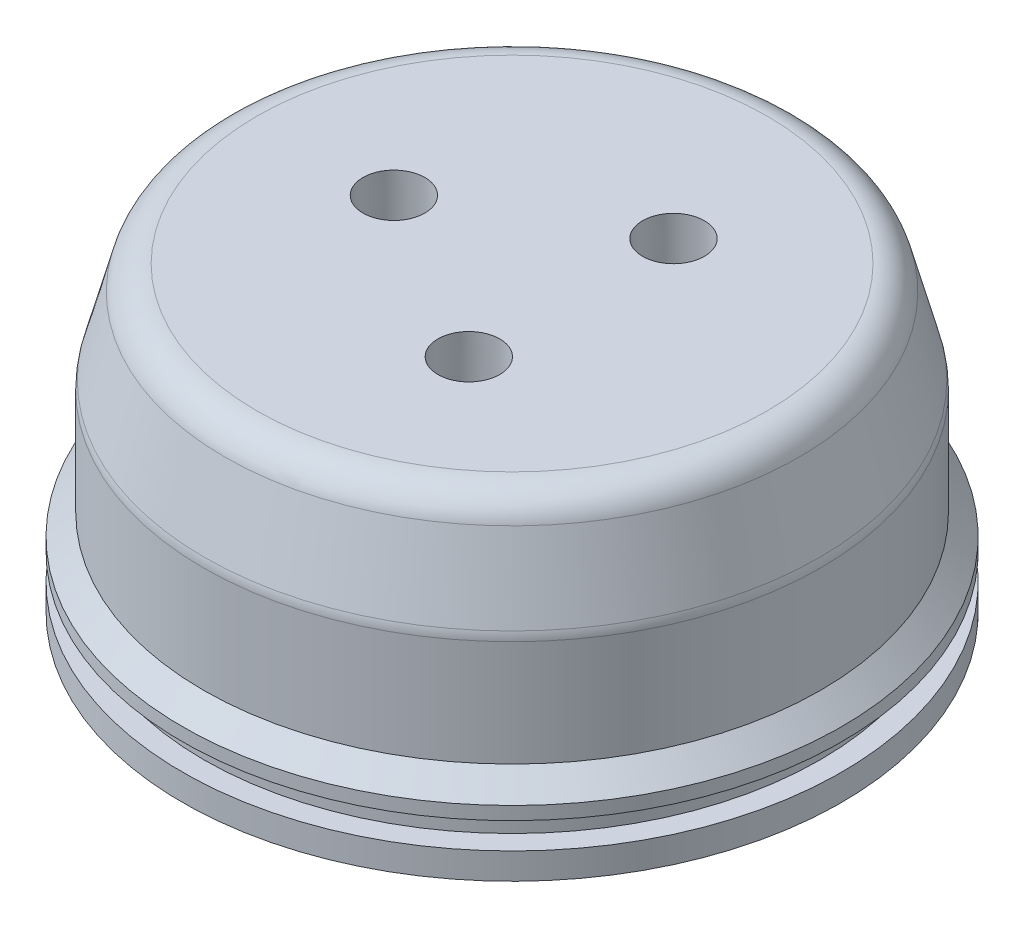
ISO-10303-21;
HEADER;
FILE_DESCRIPTION(('STEP AP214'),'2;1');
FILE_NAME('part.step','',(''),(''),'','','');
FILE_SCHEMA(('AUTOMOTIVE_DESIGN { 1 0 10303 214 1 1 1 1 }'));
ENDSEC;
DATA;
#1=APPLICATION_CONTEXT('core data for automotive mechanical design processes');
#2=APPLICATION_PROTOCOL_DEFINITION('international standard','automotive_design',2000,#1);
#3=PRODUCT_CONTEXT('',#1,'mechanical');
#4=PRODUCT('Part','Part','',(#3));
#5=PRODUCT_RELATED_PRODUCT_CATEGORY('part','',(#4));
#6=PRODUCT_DEFINITION_FORMATION('','',#4);
#7=PRODUCT_DEFINITION_CONTEXT('part definition',#1,'design');
#8=PRODUCT_DEFINITION('design','',#6,#7);
#9=PRODUCT_DEFINITION_SHAPE('','',#8);
#10=(LENGTH_UNIT() NAMED_UNIT(*) SI_UNIT(.MILLI.,.METRE.));
#11=(NAMED_UNIT(*) PLANE_ANGLE_UNIT() SI_UNIT($,.RADIAN.));
#12=(NAMED_UNIT(*) SI_UNIT($,.STERADIAN.) SOLID_ANGLE_UNIT());
#13=UNCERTAINTY_MEASURE_WITH_UNIT(LENGTH_MEASURE(1.E-05),#10,'distance_accuracy_value','');
#14=(GEOMETRIC_REPRESENTATION_CONTEXT(3) GLOBAL_UNCERTAINTY_ASSIGNED_CONTEXT((#13)) GLOBAL_UNIT_ASSIGNED_CONTEXT((#10,
#11,#12)) REPRESENTATION_CONTEXT('',''));
#15=CARTESIAN_POINT('',(0.,0.,0.));
#16=DIRECTION('',(0.,0.,1.));
#17=DIRECTION('',(1.,0.,0.));
#18=AXIS2_PLACEMENT_3D('',#15,#16,#17);
#19=CARTESIAN_POINT('',(-54.2452724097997,58.42,0.));
#20=DIRECTION('',(0.,-1.,0.));
#21=DIRECTION('',(0.,0.,-1.));
#22=AXIS2_PLACEMENT_3D('',#19,#20,#21);
#23=PLANE('',#22);
#24=CARTESIAN_POINT('',(0.,58.42,0.));
#25=DIRECTION('',(0.,-1.,0.));
#26=DIRECTION('',(0.,0.,-1.));
#27=AXIS2_PLACEMENT_3D('',#24,#25,#26);
#28=CIRCLE('',#27,49.3727460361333);
#29=CARTESIAN_POINT('',(0.,58.42,-49.3727460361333));
#30=VERTEX_POINT('',#29);
#31=EDGE_CURVE('E39',#30,#30,#28,.F.);
#32=ORIENTED_EDGE('',*,*,#31,.T.);
#33=EDGE_LOOP('',(#32));
#34=FACE_BOUND('',#33,.T.);
#35=CARTESIAN_POINT('',(11.4299999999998,58.42,19.7973407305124));
#36=DIRECTION('',(0.,-1.,0.));
#37=DIRECTION('',(0.,0.,-1.));
#38=AXIS2_PLACEMENT_3D('',#35,#36,#37);
#39=CIRCLE('',#38,5.97790349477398);
#40=CARTESIAN_POINT('',(11.4299999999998,58.42,13.8194372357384));
#41=VERTEX_POINT('',#40);
#42=EDGE_CURVE('E94',#41,#41,#39,.T.);
#43=ORIENTED_EDGE('',*,*,#42,.T.);
#44=EDGE_LOOP('',(#43));
#45=FACE_BOUND('',#44,.T.);
#46=CARTESIAN_POINT('',(-22.86,58.42,0.));
#47=DIRECTION('',(0.,-1.,0.));
#48=DIRECTION('',(0.,0.,-1.));
#49=AXIS2_PLACEMENT_3D('',#46,#47,#48);
#50=CIRCLE('',#49,5.97790349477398);
#51=CARTESIAN_POINT('',(-22.86,58.42,-5.97790349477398));
#52=VERTEX_POINT('',#51);
#53=EDGE_CURVE('E82',#52,#52,#50,.T.);
#54=ORIENTED_EDGE('',*,*,#53,.T.);
#55=EDGE_LOOP('',(#54));
#56=FACE_BOUND('',#55,.T.);
#57=CARTESIAN_POINT('',(11.4300000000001,58.42,-19.7973407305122));
#58=DIRECTION('',(0.,-1.,0.));
#59=DIRECTION('',(0.,0.,-1.));
#60=AXIS2_PLACEMENT_3D('',#57,#58,#59);
#61=CIRCLE('',#60,5.97790349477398);
#62=CARTESIAN_POINT('',(11.4300000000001,58.42,-25.7752442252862));
#63=VERTEX_POINT('',#62);
#64=EDGE_CURVE('E88',#63,#63,#61,.T.);
#65=ORIENTED_EDGE('',*,*,#64,.T.);
#66=EDGE_LOOP('',(#65));
#67=FACE_BOUND('',#66,.T.);
#68=ADVANCED_FACE('F32',(#34,#45,#56,#67),#23,.F.);
#69=CARTESIAN_POINT('',(0.,0.,0.));
#70=DIRECTION('',(0.,-1.,0.));
#71=DIRECTION('',(0.,0.,-1.));
#72=AXIS2_PLACEMENT_3D('',#69,#70,#71);
#73=CYLINDRICAL_SURFACE('',#72,63.754);
#74=CARTESIAN_POINT('',(0.,10.16,0.));
#75=DIRECTION('',(0.,-1.,0.));
#76=DIRECTION('',(0.,0.,-1.));
#77=AXIS2_PLACEMENT_3D('',#74,#75,#76);
#78=CIRCLE('',#77,63.754);
#79=CARTESIAN_POINT('',(0.,10.16,-63.754));
#80=VERTEX_POINT('',#79);
#81=EDGE_CURVE('E79',#80,#80,#78,.T.);
#82=ORIENTED_EDGE('',*,*,#81,.F.);
#83=EDGE_LOOP('',(#82));
#84=FACE_BOUND('',#83,.T.);
#85=CARTESIAN_POINT('',(0.,12.7,0.));
#86=DIRECTION('',(0.,-1.,0.));
#87=DIRECTION('',(0.,0.,-1.));
#88=AXIS2_PLACEMENT_3D('',#85,#86,#87);
#89=CIRCLE('',#88,63.754);
#90=CARTESIAN_POINT('',(0.,12.7,-63.754));
#91=VERTEX_POINT('',#90);
#92=EDGE_CURVE('E58',#91,#91,#89,.T.);
#93=ORIENTED_EDGE('',*,*,#92,.T.);
#94=EDGE_LOOP('',(#93));
#95=FACE_BOUND('',#94,.T.);
#96=ADVANCED_FACE('F125',(#84,#95),#73,.T.);
#97=CARTESIAN_POINT('',(0.,16.764,0.));
#98=DIRECTION('',(0.,-1.,0.));
#99=DIRECTION('',(0.,0.,-1.));
#100=AXIS2_PLACEMENT_3D('',#97,#98,#99);
#101=CONICAL_SURFACE('',#100,59.69,0.785398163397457);
#102=ORIENTED_EDGE('',*,*,#92,.F.);
#103=EDGE_LOOP('',(#102));
#104=FACE_BOUND('',#103,.T.);
#105=CARTESIAN_POINT('',(0.,16.764,0.));
#106=DIRECTION('',(0.,-1.,0.));
#107=DIRECTION('',(0.,0.,-1.));
#108=AXIS2_PLACEMENT_3D('',#105,#106,#107);
#109=CIRCLE('',#108,59.69);
#110=CARTESIAN_POINT('',(0.,16.764,-59.69));
#111=VERTEX_POINT('',#110);
#112=EDGE_CURVE('E61',#111,#111,#109,.T.);
#113=ORIENTED_EDGE('',*,*,#112,.T.);
#114=EDGE_LOOP('',(#113));
#115=FACE_BOUND('',#114,.T.);
#116=ADVANCED_FACE('F166',(#104,#115),#101,.T.);
#117=CARTESIAN_POINT('',(0.,0.,0.));
#118=DIRECTION('',(0.,-1.,0.));
#119=DIRECTION('',(0.,0.,-1.));
#120=AXIS2_PLACEMENT_3D('',#117,#118,#119);
#121=CYLINDRICAL_SURFACE('',#120,59.69);
#122=CARTESIAN_POINT('',(0.,37.26400664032,0.));
#123=DIRECTION('',(0.,1.,0.));
#124=DIRECTION('',(0.,0.,1.));
#125=AXIS2_PLACEMENT_3D('',#122,#123,#124);
#126=CIRCLE('',#125,59.69);
#127=CARTESIAN_POINT('',(0.,37.26400664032,59.69));
#128=VERTEX_POINT('',#127);
#129=EDGE_CURVE('E10',#128,#128,#126,.F.);
#130=ORIENTED_EDGE('',*,*,#129,.T.);
#131=EDGE_LOOP('',(#130));
#132=FACE_BOUND('',#131,.T.);
#133=ORIENTED_EDGE('',*,*,#112,.F.);
#134=EDGE_LOOP('',(#133));
#135=FACE_BOUND('',#134,.T.);
#136=ADVANCED_FACE('F162',(#132,#135),#121,.T.);
#137=CARTESIAN_POINT('',(0.,58.42,0.));
#138=DIRECTION('',(0.,-1.,0.));
#139=DIRECTION('',(0.,0.,-1.));
#140=AXIS2_PLACEMENT_3D('',#137,#138,#139);
#141=CONICAL_SURFACE('',#140,54.2452724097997,0.261799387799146);
#142=CARTESIAN_POINT('',(0.,53.713500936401,0.));
#143=DIRECTION('',(0.,1.,0.));
#144=DIRECTION('',(0.,0.,1.));
#145=AXIS2_PLACEMENT_3D('',#142,#143,#144);
#146=CIRCLE('',#145,55.5063750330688);
#147=CARTESIAN_POINT('',(0.,53.713500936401,55.5063750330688));
#148=VERTEX_POINT('',#147);
#149=EDGE_CURVE('E43',#148,#148,#146,.F.);
#150=ORIENTED_EDGE('',*,*,#149,.T.);
#151=EDGE_LOOP('',(#150));
#152=FACE_BOUND('',#151,.T.);
#153=CARTESIAN_POINT('',(0.,38.907507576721,0.));
#154=DIRECTION('',(0.,1.,0.));
#155=DIRECTION('',(0.,0.,1.));
#156=AXIS2_PLACEMENT_3D('',#153,#154,#155);
#157=CIRCLE('',#156,59.4736289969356);
#158=CARTESIAN_POINT('',(0.,38.907507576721,59.4736289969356));
#159=VERTEX_POINT('',#158);
#160=EDGE_CURVE('E47',#159,#159,#157,.T.);
#161=ORIENTED_EDGE('',*,*,#160,.T.);
#162=EDGE_LOOP('',(#161));
#163=FACE_BOUND('',#162,.T.);
#164=ADVANCED_FACE('F108',(#152,#163),#141,.T.);
#165=CARTESIAN_POINT('',(-50.8,49.53,0.));
#166=DIRECTION('',(0.,1.,0.));
#167=DIRECTION('',(0.,0.,1.));
#168=AXIS2_PLACEMENT_3D('',#165,#166,#167);
#169=PLANE('',#168);
#170=CARTESIAN_POINT('',(0.,49.53,0.));
#171=DIRECTION('',(0.,1.,0.));
#172=DIRECTION('',(0.,0.,1.));
#173=AXIS2_PLACEMENT_3D('',#170,#171,#172);
#174=CIRCLE('',#173,44.45);
#175=CARTESIAN_POINT('',(0.,49.53,44.45));
#176=VERTEX_POINT('',#175);
#177=EDGE_CURVE('E55',#176,#176,#174,.F.);
#178=ORIENTED_EDGE('',*,*,#177,.T.);
#179=EDGE_LOOP('',(#178));
#180=FACE_BOUND('',#179,.T.);
#181=CARTESIAN_POINT('',(11.4299999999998,49.53,19.7973407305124));
#182=DIRECTION('',(0.,-1.,0.));
#183=DIRECTION('',(0.,0.,-1.));
#184=AXIS2_PLACEMENT_3D('',#181,#182,#183);
#185=CIRCLE('',#184,6.244082);
#186=CARTESIAN_POINT('',(11.4299999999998,49.53,13.5532587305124));
#187=VERTEX_POINT('',#186);
#188=EDGE_CURVE('E97',#187,#187,#185,.T.);
#189=ORIENTED_EDGE('',*,*,#188,.F.);
#190=EDGE_LOOP('',(#189));
#191=FACE_BOUND('',#190,.T.);
#192=CARTESIAN_POINT('',(11.4300000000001,49.53,-19.7973407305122));
#193=DIRECTION('',(0.,-1.,0.));
#194=DIRECTION('',(0.,0.,-1.));
#195=AXIS2_PLACEMENT_3D('',#192,#193,#194);
#196=CIRCLE('',#195,6.244082);
#197=CARTESIAN_POINT('',(11.4300000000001,49.53,-26.0414227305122));
#198=VERTEX_POINT('',#197);
#199=EDGE_CURVE('E91',#198,#198,#196,.T.);
#200=ORIENTED_EDGE('',*,*,#199,.F.);
#201=EDGE_LOOP('',(#200));
#202=FACE_BOUND('',#201,.T.);
#203=CARTESIAN_POINT('',(-22.86,49.53,0.));
#204=DIRECTION('',(0.,-1.,0.));
#205=DIRECTION('',(0.,0.,-1.));
#206=AXIS2_PLACEMENT_3D('',#203,#204,#205);
#207=CIRCLE('',#206,6.244082);
#208=CARTESIAN_POINT('',(-22.86,49.53,-6.244082));
#209=VERTEX_POINT('',#208);
#210=EDGE_CURVE('E85',#209,#209,#207,.T.);
#211=ORIENTED_EDGE('',*,*,#210,.F.);
#212=EDGE_LOOP('',(#211));
#213=FACE_BOUND('',#212,.T.);
#214=ADVANCED_FACE('F104',(#180,#191,#202,#213),#169,.F.);
#215=CARTESIAN_POINT('',(0.,0.,0.));
#216=DIRECTION('',(0.,-1.,0.));
#217=DIRECTION('',(0.,0.,-1.));
#218=AXIS2_PLACEMENT_3D('',#215,#216,#217);
#219=CYLINDRICAL_SURFACE('',#218,50.8);
#220=CARTESIAN_POINT('',(0.,43.18,0.));
#221=DIRECTION('',(0.,1.,0.));
#222=DIRECTION('',(0.,0.,1.));
#223=AXIS2_PLACEMENT_3D('',#220,#221,#222);
#224=CIRCLE('',#223,50.8);
#225=CARTESIAN_POINT('',(0.,43.18,50.8));
#226=VERTEX_POINT('',#225);
#227=EDGE_CURVE('E52',#226,#226,#224,.T.);
#228=ORIENTED_EDGE('',*,*,#227,.T.);
#229=EDGE_LOOP('',(#228));
#230=FACE_BOUND('',#229,.T.);
#231=CARTESIAN_POINT('',(0.,0.,0.));
#232=DIRECTION('',(0.,-1.,0.));
#233=DIRECTION('',(0.,0.,-1.));
#234=AXIS2_PLACEMENT_3D('',#231,#232,#233);
#235=CIRCLE('',#234,50.8);
#236=CARTESIAN_POINT('',(0.,0.,-50.8));
#237=VERTEX_POINT('',#236);
#238=EDGE_CURVE('E64',#237,#237,#235,.T.);
#239=ORIENTED_EDGE('',*,*,#238,.T.);
#240=EDGE_LOOP('',(#239));
#241=FACE_BOUND('',#240,.T.);
#242=ADVANCED_FACE('F107',(#230,#241),#219,.F.);
#243=CARTESIAN_POINT('',(-50.8,0.,0.));
#244=DIRECTION('',(0.,1.,0.));
#245=DIRECTION('',(0.,0.,1.));
#246=AXIS2_PLACEMENT_3D('',#243,#244,#245);
#247=PLANE('',#246);
#248=ORIENTED_EDGE('',*,*,#238,.F.);
#249=EDGE_LOOP('',(#248));
#250=FACE_BOUND('',#249,.T.);
#251=CARTESIAN_POINT('',(0.,0.,0.));
#252=DIRECTION('',(0.,-1.,0.));
#253=DIRECTION('',(0.,0.,-1.));
#254=AXIS2_PLACEMENT_3D('',#251,#252,#253);
#255=CIRCLE('',#254,63.754);
#256=CARTESIAN_POINT('',(0.,0.,-63.754));
#257=VERTEX_POINT('',#256);
#258=EDGE_CURVE('E67',#257,#257,#255,.T.);
#259=ORIENTED_EDGE('',*,*,#258,.T.);
#260=EDGE_LOOP('',(#259));
#261=FACE_BOUND('',#260,.T.);
#262=ADVANCED_FACE('F152',(#250,#261),#247,.F.);
#263=CARTESIAN_POINT('',(0.,0.,0.));
#264=DIRECTION('',(0.,-1.,0.));
#265=DIRECTION('',(0.,0.,-1.));
#266=AXIS2_PLACEMENT_3D('',#263,#264,#265);
#267=CYLINDRICAL_SURFACE('',#266,63.754);
#268=ORIENTED_EDGE('',*,*,#258,.F.);
#269=EDGE_LOOP('',(#268));
#270=FACE_BOUND('',#269,.T.);
#271=CARTESIAN_POINT('',(0.,5.07999999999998,0.));
#272=DIRECTION('',(0.,-1.,0.));
#273=DIRECTION('',(0.,0.,-1.));
#274=AXIS2_PLACEMENT_3D('',#271,#272,#273);
#275=CIRCLE('',#274,63.754);
#276=CARTESIAN_POINT('',(0.,5.07999999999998,-63.754));
#277=VERTEX_POINT('',#276);
#278=EDGE_CURVE('E70',#277,#277,#275,.T.);
#279=ORIENTED_EDGE('',*,*,#278,.T.);
#280=EDGE_LOOP('',(#279));
#281=FACE_BOUND('',#280,.T.);
#282=ADVANCED_FACE('F148',(#270,#281),#267,.T.);
#283=CARTESIAN_POINT('',(-59.6194907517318,5.07999999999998,0.));
#284=DIRECTION('',(0.,-1.,0.));
#285=DIRECTION('',(0.,0.,-1.));
#286=AXIS2_PLACEMENT_3D('',#283,#284,#285);
#287=PLANE('',#286);
#288=ORIENTED_EDGE('',*,*,#278,.F.);
#289=EDGE_LOOP('',(#288));
#290=FACE_BOUND('',#289,.T.);
#291=CARTESIAN_POINT('',(0.,5.07999999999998,0.));
#292=DIRECTION('',(0.,-1.,0.));
#293=DIRECTION('',(0.,0.,-1.));
#294=AXIS2_PLACEMENT_3D('',#291,#292,#293);
#295=CIRCLE('',#294,59.6194907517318);
#296=CARTESIAN_POINT('',(0.,5.07999999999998,-59.6194907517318));
#297=VERTEX_POINT('',#296);
#298=EDGE_CURVE('E73',#297,#297,#295,.T.);
#299=ORIENTED_EDGE('',*,*,#298,.T.);
#300=EDGE_LOOP('',(#299));
#301=FACE_BOUND('',#300,.T.);
#302=ADVANCED_FACE('F144',(#290,#301),#287,.F.);
#303=CARTESIAN_POINT('',(0.,0.,0.));
#304=DIRECTION('',(0.,-1.,0.));
#305=DIRECTION('',(0.,0.,-1.));
#306=AXIS2_PLACEMENT_3D('',#303,#304,#305);
#307=CYLINDRICAL_SURFACE('',#306,59.6194907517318);
#308=ORIENTED_EDGE('',*,*,#298,.F.);
#309=EDGE_LOOP('',(#308));
#310=FACE_BOUND('',#309,.T.);
#311=CARTESIAN_POINT('',(0.,10.16,0.));
#312=DIRECTION('',(0.,-1.,0.));
#313=DIRECTION('',(0.,0.,-1.));
#314=AXIS2_PLACEMENT_3D('',#311,#312,#313);
#315=CIRCLE('',#314,59.6194907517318);
#316=CARTESIAN_POINT('',(0.,10.16,-59.6194907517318));
#317=VERTEX_POINT('',#316);
#318=EDGE_CURVE('E76',#317,#317,#315,.T.);
#319=ORIENTED_EDGE('',*,*,#318,.T.);
#320=EDGE_LOOP('',(#319));
#321=FACE_BOUND('',#320,.T.);
#322=ADVANCED_FACE('F140',(#310,#321),#307,.T.);
#323=CARTESIAN_POINT('',(-63.754,10.16,0.));
#324=DIRECTION('',(0.,1.,0.));
#325=DIRECTION('',(0.,0.,1.));
#326=AXIS2_PLACEMENT_3D('',#323,#324,#325);
#327=PLANE('',#326);
#328=ORIENTED_EDGE('',*,*,#318,.F.);
#329=EDGE_LOOP('',(#328));
#330=FACE_BOUND('',#329,.T.);
#331=ORIENTED_EDGE('',*,*,#81,.T.);
#332=EDGE_LOOP('',(#331));
#333=FACE_BOUND('',#332,.T.);
#334=ADVANCED_FACE('F119',(#330,#333),#327,.F.);
#335=CARTESIAN_POINT('',(-22.86,49.53,0.));
#336=DIRECTION('',(0.,-1.,0.));
#337=DIRECTION('',(0.,0.,-1.));
#338=AXIS2_PLACEMENT_3D('',#335,#336,#337);
#339=CONICAL_SURFACE('',#338,6.244082,0.0299323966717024);
#340=ORIENTED_EDGE('',*,*,#210,.T.);
#341=EDGE_LOOP('',(#340));
#342=FACE_BOUND('',#341,.T.);
#343=ORIENTED_EDGE('',*,*,#53,.F.);
#344=EDGE_LOOP('',(#343));
#345=FACE_BOUND('',#344,.T.);
#346=ADVANCED_FACE('F115',(#342,#345),#339,.F.);
#347=CARTESIAN_POINT('',(11.4300000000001,49.53,-19.7973407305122));
#348=DIRECTION('',(0.,-1.,0.));
#349=DIRECTION('',(0.,0.,-1.));
#350=AXIS2_PLACEMENT_3D('',#347,#348,#349);
#351=CONICAL_SURFACE('',#350,6.244082,0.0299323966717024);
#352=ORIENTED_EDGE('',*,*,#199,.T.);
#353=EDGE_LOOP('',(#352));
#354=FACE_BOUND('',#353,.T.);
#355=ORIENTED_EDGE('',*,*,#64,.F.);
#356=EDGE_LOOP('',(#355));
#357=FACE_BOUND('',#356,.T.);
#358=ADVANCED_FACE('F118',(#354,#357),#351,.F.);
#359=CARTESIAN_POINT('',(11.4299999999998,49.53,19.7973407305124));
#360=DIRECTION('',(0.,-1.,0.));
#361=DIRECTION('',(0.,0.,-1.));
#362=AXIS2_PLACEMENT_3D('',#359,#360,#361);
#363=CONICAL_SURFACE('',#362,6.244082,0.0299323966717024);
#364=ORIENTED_EDGE('',*,*,#188,.T.);
#365=EDGE_LOOP('',(#364));
#366=FACE_BOUND('',#365,.T.);
#367=ORIENTED_EDGE('',*,*,#42,.F.);
#368=EDGE_LOOP('',(#367));
#369=FACE_BOUND('',#368,.T.);
#370=ADVANCED_FACE('F101',(#366,#369),#363,.F.);
#371=CARTESIAN_POINT('',(0.,43.18,0.));
#372=DIRECTION('',(0.,1.,0.));
#373=DIRECTION('',(0.,0.,1.));
#374=AXIS2_PLACEMENT_3D('',#371,#372,#373);
#375=TOROIDAL_SURFACE('',#374,44.45,6.35);
#376=ORIENTED_EDGE('',*,*,#227,.F.);
#377=EDGE_LOOP('',(#376));
#378=FACE_BOUND('',#377,.T.);
#379=ORIENTED_EDGE('',*,*,#177,.F.);
#380=EDGE_LOOP('',(#379));
#381=FACE_BOUND('',#380,.T.);
#382=ADVANCED_FACE('F135',(#378,#381),#375,.F.);
#383=CARTESIAN_POINT('',(0.,52.07,0.));
#384=DIRECTION('',(0.,-1.,0.));
#385=DIRECTION('',(0.,0.,-1.));
#386=AXIS2_PLACEMENT_3D('',#383,#384,#385);
#387=TOROIDAL_SURFACE('',#386,49.3727460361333,6.35);
#388=ORIENTED_EDGE('',*,*,#31,.F.);
#389=EDGE_LOOP('',(#388));
#390=FACE_BOUND('',#389,.T.);
#391=ORIENTED_EDGE('',*,*,#149,.F.);
#392=EDGE_LOOP('',(#391));
#393=FACE_BOUND('',#392,.T.);
#394=ADVANCED_FACE('F174',(#390,#393),#387,.T.);
#395=CARTESIAN_POINT('',(0.,37.26400664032,0.));
#396=DIRECTION('',(0.,1.,0.));
#397=DIRECTION('',(0.,0.,1.));
#398=AXIS2_PLACEMENT_3D('',#395,#396,#397);
#399=TOROIDAL_SURFACE('',#398,53.34,6.35);
#400=ORIENTED_EDGE('',*,*,#160,.F.);
#401=EDGE_LOOP('',(#400));
#402=FACE_BOUND('',#401,.T.);
#403=ORIENTED_EDGE('',*,*,#129,.F.);
#404=EDGE_LOOP('',(#403));
#405=FACE_BOUND('',#404,.T.);
#406=ADVANCED_FACE('F34',(#402,#405),#399,.T.);
#407=CLOSED_SHELL('',(#68,#96,#116,#136,#164,#214,#242,#262,#282,#302,#322,#334,#346,#358,#370,
#382,#394,#406));
#408=MANIFOLD_SOLID_BREP('B2',#407);
#409=ADVANCED_BREP_SHAPE_REPRESENTATION('',(#18,#408),#14);
#410=SHAPE_DEFINITION_REPRESENTATION(#9,#409);
ENDSEC;
END-ISO-10303-21;
